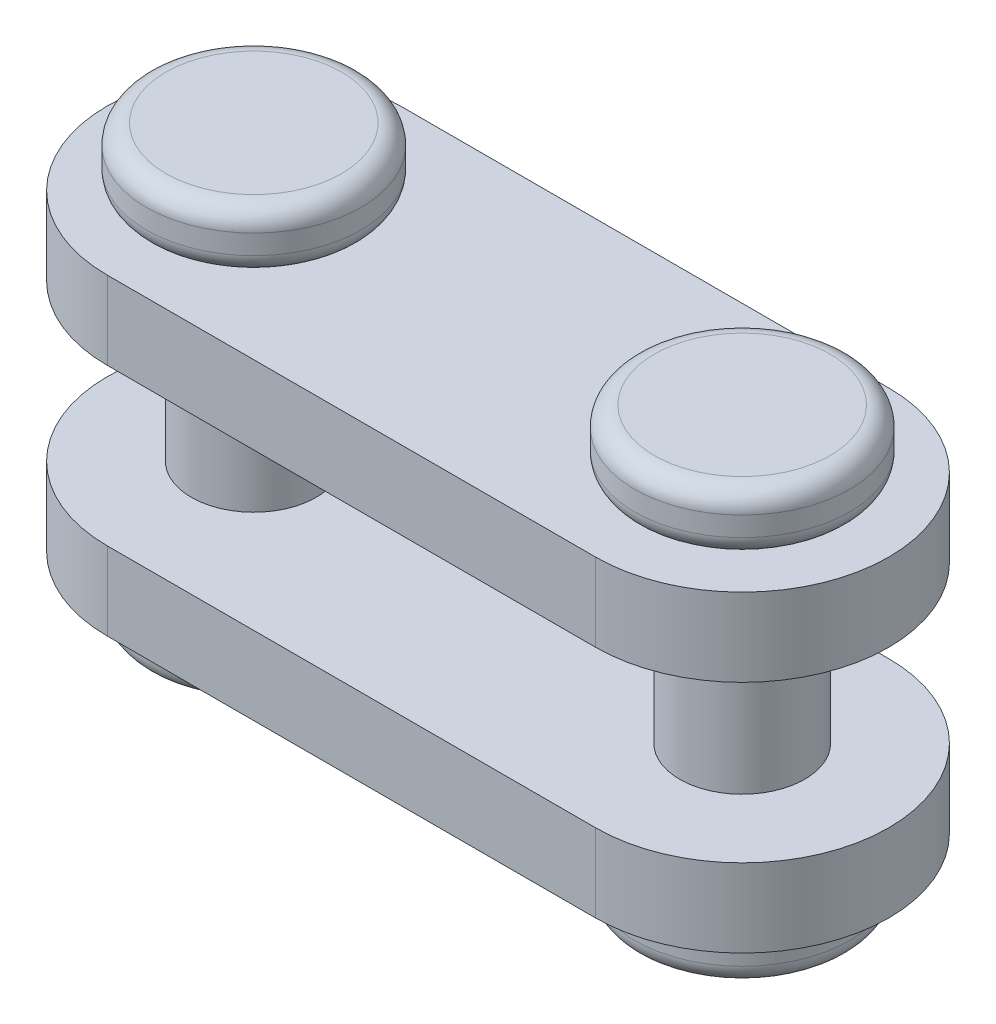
ISO-10303-21;
HEADER;
FILE_DESCRIPTION(('STEP AP214'),'2;1');
FILE_NAME('part.step','',(''),(''),'','','');
FILE_SCHEMA(('AUTOMOTIVE_DESIGN { 1 0 10303 214 1 1 1 1 }'));
ENDSEC;
DATA;
#1=APPLICATION_CONTEXT('core data for automotive mechanical design processes');
#2=APPLICATION_PROTOCOL_DEFINITION('international standard','automotive_design',2000,#1);
#3=PRODUCT_CONTEXT('',#1,'mechanical');
#4=PRODUCT('Part','Part','',(#3));
#5=PRODUCT_RELATED_PRODUCT_CATEGORY('part','',(#4));
#6=PRODUCT_DEFINITION_FORMATION('','',#4);
#7=PRODUCT_DEFINITION_CONTEXT('part definition',#1,'design');
#8=PRODUCT_DEFINITION('design','',#6,#7);
#9=PRODUCT_DEFINITION_SHAPE('','',#8);
#10=(LENGTH_UNIT() NAMED_UNIT(*) SI_UNIT(.MILLI.,.METRE.));
#11=(NAMED_UNIT(*) PLANE_ANGLE_UNIT() SI_UNIT($,.RADIAN.));
#12=(NAMED_UNIT(*) SI_UNIT($,.STERADIAN.) SOLID_ANGLE_UNIT());
#13=UNCERTAINTY_MEASURE_WITH_UNIT(LENGTH_MEASURE(1.E-05),#10,'distance_accuracy_value','');
#14=(GEOMETRIC_REPRESENTATION_CONTEXT(3) GLOBAL_UNCERTAINTY_ASSIGNED_CONTEXT((#13)) GLOBAL_UNIT_ASSIGNED_CONTEXT((#10,
#11,#12)) REPRESENTATION_CONTEXT('',''));
#15=CARTESIAN_POINT('',(0.,0.,0.));
#16=DIRECTION('',(0.,0.,1.));
#17=DIRECTION('',(1.,0.,0.));
#18=AXIS2_PLACEMENT_3D('',#15,#16,#17);
#19=CARTESIAN_POINT('',(12.5000000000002,-4.00000000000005,-5.67254576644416E-13));
#20=DIRECTION('',(0.,1.,0.));
#21=DIRECTION('',(1.,0.,0.));
#22=AXIS2_PLACEMENT_3D('',#19,#20,#21);
#23=CYLINDRICAL_SURFACE('',#22,3.75);
#24=DIRECTION('',(0.,1.,0.));
#25=VECTOR('',#24,1.);
#26=CARTESIAN_POINT('',(12.5000000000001,-4.00000000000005,-3.75000000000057));
#27=LINE('',#26,#25);
#28=CARTESIAN_POINT('',(12.5000000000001,-4.00000000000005,-3.75000000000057));
#29=VERTEX_POINT('',#28);
#30=CARTESIAN_POINT('',(12.5000000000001,-2.00000000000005,-3.75000000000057));
#31=VERTEX_POINT('',#30);
#32=EDGE_CURVE('E752',#29,#31,#27,.T.);
#33=ORIENTED_EDGE('',*,*,#32,.T.);
#34=CARTESIAN_POINT('',(12.5000000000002,-2.00000000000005,-5.67254576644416E-13));
#35=DIRECTION('',(0.,1.,0.));
#36=DIRECTION('',(1.,0.,0.));
#37=AXIS2_PLACEMENT_3D('',#34,#35,#36);
#38=CIRCLE('',#37,3.75);
#39=CARTESIAN_POINT('',(12.5000000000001,-2.00000000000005,3.74999999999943));
#40=VERTEX_POINT('',#39);
#41=EDGE_CURVE('E770',#31,#40,#38,.F.);
#42=ORIENTED_EDGE('',*,*,#41,.T.);
#43=DIRECTION('',(0.,-1.,0.));
#44=VECTOR('',#43,1.);
#45=CARTESIAN_POINT('',(12.5000000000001,-4.00000000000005,3.74999999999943));
#46=LINE('',#45,#44);
#47=CARTESIAN_POINT('',(12.5000000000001,-4.00000000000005,3.74999999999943));
#48=VERTEX_POINT('',#47);
#49=EDGE_CURVE('E763',#40,#48,#46,.T.);
#50=ORIENTED_EDGE('',*,*,#49,.T.);
#51=CARTESIAN_POINT('',(12.5000000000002,-4.00000000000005,-5.67254576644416E-13));
#52=DIRECTION('',(0.,1.,0.));
#53=DIRECTION('',(1.,0.,0.));
#54=AXIS2_PLACEMENT_3D('',#51,#52,#53);
#55=CIRCLE('',#54,3.75);
#56=EDGE_CURVE('E753',#48,#29,#55,.T.);
#57=ORIENTED_EDGE('',*,*,#56,.T.);
#58=EDGE_LOOP('',(#33,#42,#50,#57));
#59=FACE_BOUND('',#58,.T.);
#60=ADVANCED_FACE('F14',(#59),#23,.T.);
#61=CARTESIAN_POINT('',(12.5000000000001,-4.00000000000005,3.74999999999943));
#62=DIRECTION('',(0.,0.,-1.));
#63=DIRECTION('',(0.,-1.,0.));
#64=AXIS2_PLACEMENT_3D('',#61,#62,#63);
#65=PLANE('',#64);
#66=DIRECTION('',(0.,1.,0.));
#67=VECTOR('',#66,1.);
#68=CARTESIAN_POINT('',(1.38777878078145E-13,-4.00000000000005,3.74999999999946));
#69=LINE('',#68,#67);
#70=CARTESIAN_POINT('',(1.38777878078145E-13,-4.00000000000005,3.74999999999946));
#71=VERTEX_POINT('',#70);
#72=CARTESIAN_POINT('',(1.38777878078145E-13,-2.00000000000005,3.74999999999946));
#73=VERTEX_POINT('',#72);
#74=EDGE_CURVE('E744',#71,#73,#69,.T.);
#75=ORIENTED_EDGE('',*,*,#74,.F.);
#76=DIRECTION('',(-1.,0.,0.));
#77=VECTOR('',#76,1.);
#78=CARTESIAN_POINT('',(12.5000000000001,-4.00000000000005,3.74999999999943));
#79=LINE('',#78,#77);
#80=EDGE_CURVE('E739',#48,#71,#79,.T.);
#81=ORIENTED_EDGE('',*,*,#80,.F.);
#82=ORIENTED_EDGE('',*,*,#49,.F.);
#83=DIRECTION('',(-1.,0.,0.));
#84=VECTOR('',#83,1.);
#85=CARTESIAN_POINT('',(12.5000000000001,-2.00000000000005,3.74999999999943));
#86=LINE('',#85,#84);
#87=EDGE_CURVE('E769',#40,#73,#86,.T.);
#88=ORIENTED_EDGE('',*,*,#87,.T.);
#89=EDGE_LOOP('',(#75,#81,#82,#88));
#90=FACE_BOUND('',#89,.T.);
#91=ADVANCED_FACE('F648',(#90),#65,.F.);
#92=CARTESIAN_POINT('',(1.17961196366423E-13,-4.00000000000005,-5.42968447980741E-13));
#93=DIRECTION('',(0.,1.,0.));
#94=DIRECTION('',(1.,0.,0.));
#95=AXIS2_PLACEMENT_3D('',#92,#93,#94);
#96=CYLINDRICAL_SURFACE('',#95,3.75);
#97=CARTESIAN_POINT('',(1.17961196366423E-13,-4.00000000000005,-5.42968447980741E-13));
#98=DIRECTION('',(0.,1.,0.));
#99=DIRECTION('',(1.,0.,0.));
#100=AXIS2_PLACEMENT_3D('',#97,#98,#99);
#101=CIRCLE('',#100,3.75);
#102=CARTESIAN_POINT('',(1.52655665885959E-13,-4.00000000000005,-3.75000000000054));
#103=VERTEX_POINT('',#102);
#104=EDGE_CURVE('E731',#103,#71,#101,.T.);
#105=ORIENTED_EDGE('',*,*,#104,.T.);
#106=ORIENTED_EDGE('',*,*,#74,.T.);
#107=CARTESIAN_POINT('',(1.17961196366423E-13,-2.00000000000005,-5.42968447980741E-13));
#108=DIRECTION('',(0.,1.,0.));
#109=DIRECTION('',(1.,0.,0.));
#110=AXIS2_PLACEMENT_3D('',#107,#108,#109);
#111=CIRCLE('',#110,3.75);
#112=CARTESIAN_POINT('',(1.52655665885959E-13,-2.00000000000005,-3.75000000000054));
#113=VERTEX_POINT('',#112);
#114=EDGE_CURVE('E757',#73,#113,#111,.F.);
#115=ORIENTED_EDGE('',*,*,#114,.T.);
#116=DIRECTION('',(0.,1.,0.));
#117=VECTOR('',#116,1.);
#118=CARTESIAN_POINT('',(1.52655665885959E-13,-4.00000000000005,-3.75000000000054));
#119=LINE('',#118,#117);
#120=EDGE_CURVE('E749',#113,#103,#119,.F.);
#121=ORIENTED_EDGE('',*,*,#120,.T.);
#122=EDGE_LOOP('',(#105,#106,#115,#121));
#123=FACE_BOUND('',#122,.T.);
#124=ADVANCED_FACE('F658',(#123),#96,.T.);
#125=CARTESIAN_POINT('',(1.52655665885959E-13,-4.00000000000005,-3.75000000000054));
#126=DIRECTION('',(0.,0.,1.));
#127=DIRECTION('',(0.,1.,0.));
#128=AXIS2_PLACEMENT_3D('',#125,#126,#127);
#129=PLANE('',#128);
#130=ORIENTED_EDGE('',*,*,#32,.F.);
#131=DIRECTION('',(-1.,0.,0.));
#132=VECTOR('',#131,1.);
#133=CARTESIAN_POINT('',(1.52655665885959E-13,-4.00000000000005,-3.75000000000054));
#134=LINE('',#133,#132);
#135=EDGE_CURVE('E735',#103,#29,#134,.F.);
#136=ORIENTED_EDGE('',*,*,#135,.F.);
#137=ORIENTED_EDGE('',*,*,#120,.F.);
#138=DIRECTION('',(-1.,0.,0.));
#139=VECTOR('',#138,1.);
#140=CARTESIAN_POINT('',(12.5000000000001,-2.00000000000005,-3.75000000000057));
#141=LINE('',#140,#139);
#142=EDGE_CURVE('E768',#113,#31,#141,.F.);
#143=ORIENTED_EDGE('',*,*,#142,.T.);
#144=EDGE_LOOP('',(#130,#136,#137,#143));
#145=FACE_BOUND('',#144,.T.);
#146=ADVANCED_FACE('F667',(#145),#129,.F.);
#147=CARTESIAN_POINT('',(12.5000000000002,-2.00000000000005,-5.67254576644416E-13));
#148=DIRECTION('',(0.,-1.,0.));
#149=DIRECTION('',(-1.,0.,0.));
#150=AXIS2_PLACEMENT_3D('',#147,#148,#149);
#151=PLANE('',#150);
#152=ORIENTED_EDGE('',*,*,#142,.F.);
#153=ORIENTED_EDGE('',*,*,#114,.F.);
#154=ORIENTED_EDGE('',*,*,#87,.F.);
#155=ORIENTED_EDGE('',*,*,#41,.F.);
#156=EDGE_LOOP('',(#152,#153,#154,#155));
#157=FACE_BOUND('',#156,.T.);
#158=CARTESIAN_POINT('',(1.17961196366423E-13,-2.00000000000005,-5.42968447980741E-13));
#159=DIRECTION('',(0.,-1.,0.));
#160=DIRECTION('',(-1.,0.,0.));
#161=AXIS2_PLACEMENT_3D('',#158,#159,#160);
#162=CIRCLE('',#161,1.6);
#163=CARTESIAN_POINT('',(-1.59999999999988,-2.00000000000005,-5.40836819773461E-13));
#164=VERTEX_POINT('',#163);
#165=EDGE_CURVE('E773',#164,#164,#162,.F.);
#166=ORIENTED_EDGE('',*,*,#165,.F.);
#167=EDGE_LOOP('',(#166));
#168=FACE_BOUND('',#167,.T.);
#169=CARTESIAN_POINT('',(12.5000000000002,-2.00000000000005,-5.67254576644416E-13));
#170=DIRECTION('',(0.,-1.,0.));
#171=DIRECTION('',(-1.,0.,0.));
#172=AXIS2_PLACEMENT_3D('',#169,#170,#171);
#173=CIRCLE('',#172,1.6);
#174=CARTESIAN_POINT('',(10.9000000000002,-2.00000000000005,-5.65122948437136E-13));
#175=VERTEX_POINT('',#174);
#176=EDGE_CURVE('E776',#175,#175,#173,.F.);
#177=ORIENTED_EDGE('',*,*,#176,.F.);
#178=EDGE_LOOP('',(#177));
#179=FACE_BOUND('',#178,.T.);
#180=ADVANCED_FACE('F677',(#157,#168,#179),#151,.F.);
#181=CARTESIAN_POINT('',(12.5000000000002,-4.00000000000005,-5.67254576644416E-13));
#182=DIRECTION('',(0.,-1.,0.));
#183=DIRECTION('',(-1.,0.,0.));
#184=AXIS2_PLACEMENT_3D('',#181,#182,#183);
#185=PLANE('',#184);
#186=CARTESIAN_POINT('',(12.5,-4.,-2.09901540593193E-13));
#187=DIRECTION('',(0.,-1.,0.));
#188=DIRECTION('',(-0.784264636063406,0.,-0.620426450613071));
#189=AXIS2_PLACEMENT_3D('',#186,#187,#188);
#190=CIRCLE('',#189,2.25);
#191=CARTESIAN_POINT('',(14.2645954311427,-4.00000000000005,1.39595951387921));
#192=VERTEX_POINT('',#191);
#193=CARTESIAN_POINT('',(10.7354045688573,-4.00000000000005,-1.39595951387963));
#194=VERTEX_POINT('',#193);
#195=EDGE_CURVE('E220',#192,#194,#190,.F.);
#196=ORIENTED_EDGE('',*,*,#195,.T.);
#197=CARTESIAN_POINT('',(12.5,-4.,-2.09901540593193E-13));
#198=DIRECTION('',(0.,-1.,0.));
#199=DIRECTION('',(0.784264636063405,0.,0.620426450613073));
#200=AXIS2_PLACEMENT_3D('',#197,#198,#199);
#201=CIRCLE('',#200,2.25);
#202=EDGE_CURVE('E790',#194,#192,#201,.F.);
#203=ORIENTED_EDGE('',*,*,#202,.T.);
#204=EDGE_LOOP('',(#196,#203));
#205=FACE_BOUND('',#204,.T.);
#206=ORIENTED_EDGE('',*,*,#104,.F.);
#207=ORIENTED_EDGE('',*,*,#135,.T.);
#208=ORIENTED_EDGE('',*,*,#56,.F.);
#209=ORIENTED_EDGE('',*,*,#80,.T.);
#210=EDGE_LOOP('',(#206,#207,#208,#209));
#211=FACE_BOUND('',#210,.T.);
#212=CARTESIAN_POINT('',(0.,-4.00000000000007,0.));
#213=DIRECTION('',(0.,-1.,0.));
#214=DIRECTION('',(-0.653512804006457,0.,0.756915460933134));
#215=AXIS2_PLACEMENT_3D('',#212,#213,#214);
#216=CIRCLE('',#215,2.25000000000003);
#217=CARTESIAN_POINT('',(1.47040380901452,-4.00000000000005,-1.70305978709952));
#218=VERTEX_POINT('',#217);
#219=CARTESIAN_POINT('',(-1.47040380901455,-4.00000000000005,1.70305978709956));
#220=VERTEX_POINT('',#219);
#221=EDGE_CURVE('E27',#218,#220,#216,.F.);
#222=ORIENTED_EDGE('',*,*,#221,.T.);
#223=CARTESIAN_POINT('',(0.,-4.00000000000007,0.));
#224=DIRECTION('',(0.,-1.,0.));
#225=DIRECTION('',(0.653512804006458,0.,-0.756915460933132));
#226=AXIS2_PLACEMENT_3D('',#223,#224,#225);
#227=CIRCLE('',#226,2.25000000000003);
#228=EDGE_CURVE('E9',#220,#218,#227,.F.);
#229=ORIENTED_EDGE('',*,*,#228,.T.);
#230=EDGE_LOOP('',(#222,#229));
#231=FACE_BOUND('',#230,.T.);
#232=ADVANCED_FACE('F202',(#205,#211,#231),#185,.T.);
#233=CARTESIAN_POINT('',(12.5,5.49999999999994,-2.09901540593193E-13));
#234=DIRECTION('',(0.,-1.,0.));
#235=DIRECTION('',(0.784264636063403,0.,0.620426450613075));
#236=AXIS2_PLACEMENT_3D('',#233,#234,#235);
#237=PLANE('',#236);
#238=CARTESIAN_POINT('',(12.5,5.5,-2.09901540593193E-13));
#239=DIRECTION('',(0.,-1.,0.));
#240=DIRECTION('',(0.784264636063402,0.,0.620426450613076));
#241=AXIS2_PLACEMENT_3D('',#238,#239,#240);
#242=CIRCLE('',#241,2.25000000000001);
#243=CARTESIAN_POINT('',(14.2645954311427,5.49999999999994,1.39595951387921));
#244=VERTEX_POINT('',#243);
#245=CARTESIAN_POINT('',(10.7354045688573,5.49999999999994,-1.39595951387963));
#246=VERTEX_POINT('',#245);
#247=EDGE_CURVE('E109',#244,#246,#242,.T.);
#248=ORIENTED_EDGE('',*,*,#247,.F.);
#249=CARTESIAN_POINT('',(12.5,5.5,-2.09901540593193E-13));
#250=DIRECTION('',(0.,-1.,0.));
#251=DIRECTION('',(-0.784264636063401,0.,-0.620426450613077));
#252=AXIS2_PLACEMENT_3D('',#249,#250,#251);
#253=CIRCLE('',#252,2.25000000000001);
#254=EDGE_CURVE('E143',#246,#244,#253,.T.);
#255=ORIENTED_EDGE('',*,*,#254,.F.);
#256=EDGE_LOOP('',(#248,#255));
#257=FACE_BOUND('',#256,.T.);
#258=ADVANCED_FACE('F133',(#257),#237,.F.);
#259=CARTESIAN_POINT('',(0.,5.49999999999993,0.));
#260=DIRECTION('',(0.,-1.,0.));
#261=DIRECTION('',(0.653512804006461,0.,-0.75691546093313));
#262=AXIS2_PLACEMENT_3D('',#259,#260,#261);
#263=PLANE('',#262);
#264=CARTESIAN_POINT('',(0.,5.49999999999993,0.));
#265=DIRECTION('',(0.,-1.,0.));
#266=DIRECTION('',(0.653512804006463,0.,-0.756915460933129));
#267=AXIS2_PLACEMENT_3D('',#264,#265,#266);
#268=CIRCLE('',#267,2.24999999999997);
#269=CARTESIAN_POINT('',(1.47040380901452,5.49999999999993,-1.70305978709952));
#270=VERTEX_POINT('',#269);
#271=CARTESIAN_POINT('',(-1.47040380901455,5.49999999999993,1.70305978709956));
#272=VERTEX_POINT('',#271);
#273=EDGE_CURVE('E318',#270,#272,#268,.T.);
#274=ORIENTED_EDGE('',*,*,#273,.F.);
#275=CARTESIAN_POINT('',(0.,5.49999999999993,0.));
#276=DIRECTION('',(0.,-1.,0.));
#277=DIRECTION('',(-0.653512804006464,0.,0.756915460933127));
#278=AXIS2_PLACEMENT_3D('',#275,#276,#277);
#279=CIRCLE('',#278,2.24999999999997);
#280=EDGE_CURVE('E315',#272,#270,#279,.T.);
#281=ORIENTED_EDGE('',*,*,#280,.F.);
#282=EDGE_LOOP('',(#274,#281));
#283=FACE_BOUND('',#282,.T.);
#284=ADVANCED_FACE('F243',(#283),#263,.F.);
#285=CARTESIAN_POINT('',(12.5,5.,-2.09901540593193E-13));
#286=DIRECTION('',(0.,-1.,0.));
#287=DIRECTION('',(0.784264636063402,0.,0.620426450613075));
#288=AXIS2_PLACEMENT_3D('',#285,#286,#287);
#289=TOROIDAL_SURFACE('',#288,2.25000000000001,0.5);
#290=ORIENTED_EDGE('',*,*,#247,.T.);
#291=ORIENTED_EDGE('',*,*,#254,.T.);
#292=EDGE_LOOP('',(#290,#291));
#293=FACE_BOUND('',#292,.T.);
#294=CARTESIAN_POINT('',(12.5,5.,-2.09901540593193E-13));
#295=DIRECTION('',(0.,1.,0.));
#296=DIRECTION('',(-0.784264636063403,0.,-0.620426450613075));
#297=AXIS2_PLACEMENT_3D('',#294,#295,#296);
#298=CIRCLE('',#297,2.75);
#299=CARTESIAN_POINT('',(10.3432722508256,5.,-1.70617273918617));
#300=VERTEX_POINT('',#299);
#301=EDGE_CURVE('E139',#300,#300,#298,.F.);
#302=ORIENTED_EDGE('',*,*,#301,.F.);
#303=EDGE_LOOP('',(#302));
#304=FACE_BOUND('',#303,.T.);
#305=ADVANCED_FACE('F129',(#293,#304),#289,.T.);
#306=CARTESIAN_POINT('',(0.,4.99999999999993,0.));
#307=DIRECTION('',(0.,-1.,0.));
#308=DIRECTION('',(0.653512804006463,0.,-0.756915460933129));
#309=AXIS2_PLACEMENT_3D('',#306,#307,#308);
#310=TOROIDAL_SURFACE('',#309,2.24999999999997,0.5);
#311=ORIENTED_EDGE('',*,*,#273,.T.);
#312=ORIENTED_EDGE('',*,*,#280,.T.);
#313=EDGE_LOOP('',(#311,#312));
#314=FACE_BOUND('',#313,.T.);
#315=CARTESIAN_POINT('',(0.,4.99999999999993,0.));
#316=DIRECTION('',(0.,1.,0.));
#317=DIRECTION('',(-0.653512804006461,0.,0.75691546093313));
#318=AXIS2_PLACEMENT_3D('',#315,#316,#317);
#319=CIRCLE('',#318,2.75);
#320=CARTESIAN_POINT('',(-1.79716021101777,4.99999999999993,2.08151751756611));
#321=VERTEX_POINT('',#320);
#322=EDGE_CURVE('E308',#321,#321,#319,.F.);
#323=ORIENTED_EDGE('',*,*,#322,.F.);
#324=EDGE_LOOP('',(#323));
#325=FACE_BOUND('',#324,.T.);
#326=ADVANCED_FACE('F242',(#314,#325),#310,.T.);
#327=CARTESIAN_POINT('',(12.5,3.99999999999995,-2.09901540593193E-13));
#328=DIRECTION('',(0.,1.,0.));
#329=DIRECTION('',(-0.784264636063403,0.,-0.620426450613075));
#330=AXIS2_PLACEMENT_3D('',#327,#328,#329);
#331=CYLINDRICAL_SURFACE('',#330,2.75);
#332=CARTESIAN_POINT('',(12.5,4.49999999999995,-2.09901540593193E-13));
#333=DIRECTION('',(0.,-1.,0.));
#334=DIRECTION('',(0.784264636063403,0.,0.620426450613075));
#335=AXIS2_PLACEMENT_3D('',#332,#333,#334);
#336=CIRCLE('',#335,2.75);
#337=CARTESIAN_POINT('',(14.6567277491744,4.49999999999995,1.70617273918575));
#338=VERTEX_POINT('',#337);
#339=EDGE_CURVE('E225',#338,#338,#336,.T.);
#340=ORIENTED_EDGE('',*,*,#339,.F.);
#341=EDGE_LOOP('',(#340));
#342=FACE_BOUND('',#341,.T.);
#343=ORIENTED_EDGE('',*,*,#301,.T.);
#344=EDGE_LOOP('',(#343));
#345=FACE_BOUND('',#344,.T.);
#346=ADVANCED_FACE('F207',(#342,#345),#331,.T.);
#347=CARTESIAN_POINT('',(0.,3.99999999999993,0.));
#348=DIRECTION('',(0.,1.,0.));
#349=DIRECTION('',(-0.653512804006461,0.,0.75691546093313));
#350=AXIS2_PLACEMENT_3D('',#347,#348,#349);
#351=CYLINDRICAL_SURFACE('',#350,2.75);
#352=CARTESIAN_POINT('',(0.,4.49999999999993,0.));
#353=DIRECTION('',(0.,-1.,0.));
#354=DIRECTION('',(0.653512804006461,0.,-0.75691546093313));
#355=AXIS2_PLACEMENT_3D('',#352,#353,#354);
#356=CIRCLE('',#355,2.75);
#357=CARTESIAN_POINT('',(1.79716021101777,4.49999999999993,-2.08151751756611));
#358=VERTEX_POINT('',#357);
#359=EDGE_CURVE('E485',#358,#358,#356,.T.);
#360=ORIENTED_EDGE('',*,*,#359,.F.);
#361=EDGE_LOOP('',(#360));
#362=FACE_BOUND('',#361,.T.);
#363=ORIENTED_EDGE('',*,*,#322,.T.);
#364=EDGE_LOOP('',(#363));
#365=FACE_BOUND('',#364,.T.);
#366=ADVANCED_FACE('F252',(#362,#365),#351,.T.);
#367=CARTESIAN_POINT('',(12.5,4.49999999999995,-2.09901540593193E-13));
#368=DIRECTION('',(0.,-1.,0.));
#369=DIRECTION('',(0.784264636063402,0.,0.620426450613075));
#370=AXIS2_PLACEMENT_3D('',#367,#368,#369);
#371=TOROIDAL_SURFACE('',#370,2.25000000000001,0.5);
#372=ORIENTED_EDGE('',*,*,#339,.T.);
#373=EDGE_LOOP('',(#372));
#374=FACE_BOUND('',#373,.T.);
#375=CARTESIAN_POINT('',(12.5,3.99999999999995,-2.09901540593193E-13));
#376=DIRECTION('',(0.,1.,0.));
#377=DIRECTION('',(0.7842646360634,0.,0.620426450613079));
#378=AXIS2_PLACEMENT_3D('',#375,#376,#377);
#379=CIRCLE('',#378,2.25000000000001);
#380=CARTESIAN_POINT('',(10.7354045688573,3.99999999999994,-1.39595951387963));
#381=VERTEX_POINT('',#380);
#382=CARTESIAN_POINT('',(14.2645954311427,3.99999999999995,1.39595951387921));
#383=VERTEX_POINT('',#382);
#384=EDGE_CURVE('E422',#381,#383,#379,.F.);
#385=ORIENTED_EDGE('',*,*,#384,.F.);
#386=CARTESIAN_POINT('',(12.5,3.99999999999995,-2.09901540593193E-13));
#387=DIRECTION('',(0.,1.,0.));
#388=DIRECTION('',(-0.784264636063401,0.,-0.620426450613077));
#389=AXIS2_PLACEMENT_3D('',#386,#387,#388);
#390=CIRCLE('',#389,2.25000000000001);
#391=EDGE_CURVE('E424',#383,#381,#390,.F.);
#392=ORIENTED_EDGE('',*,*,#391,.F.);
#393=EDGE_LOOP('',(#385,#392));
#394=FACE_BOUND('',#393,.T.);
#395=ADVANCED_FACE('F203',(#374,#394),#371,.T.);
#396=CARTESIAN_POINT('',(0.,4.49999999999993,0.));
#397=DIRECTION('',(0.,-1.,0.));
#398=DIRECTION('',(0.653512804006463,0.,-0.756915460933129));
#399=AXIS2_PLACEMENT_3D('',#396,#397,#398);
#400=TOROIDAL_SURFACE('',#399,2.24999999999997,0.5);
#401=ORIENTED_EDGE('',*,*,#359,.T.);
#402=EDGE_LOOP('',(#401));
#403=FACE_BOUND('',#402,.T.);
#404=CARTESIAN_POINT('',(0.,3.99999999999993,0.));
#405=DIRECTION('',(0.,1.,0.));
#406=DIRECTION('',(0.653512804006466,0.,-0.756915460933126));
#407=AXIS2_PLACEMENT_3D('',#404,#405,#406);
#408=CIRCLE('',#407,2.24999999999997);
#409=CARTESIAN_POINT('',(-1.47040380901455,3.99999999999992,1.70305978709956));
#410=VERTEX_POINT('',#409);
#411=CARTESIAN_POINT('',(1.47040380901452,3.99999999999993,-1.70305978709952));
#412=VERTEX_POINT('',#411);
#413=EDGE_CURVE('E430',#410,#412,#408,.F.);
#414=ORIENTED_EDGE('',*,*,#413,.F.);
#415=CARTESIAN_POINT('',(0.,3.99999999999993,0.));
#416=DIRECTION('',(0.,1.,0.));
#417=DIRECTION('',(-0.653512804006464,0.,0.756915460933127));
#418=AXIS2_PLACEMENT_3D('',#415,#416,#417);
#419=CIRCLE('',#418,2.24999999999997);
#420=EDGE_CURVE('E384',#412,#410,#419,.F.);
#421=ORIENTED_EDGE('',*,*,#420,.F.);
#422=EDGE_LOOP('',(#414,#421));
#423=FACE_BOUND('',#422,.T.);
#424=ADVANCED_FACE('F259',(#403,#423),#400,.T.);
#425=CARTESIAN_POINT('',(12.5000000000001,3.99999999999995,-5.36029554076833E-13));
#426=DIRECTION('',(0.,-1.,0.));
#427=DIRECTION('',(-1.,0.,0.));
#428=AXIS2_PLACEMENT_3D('',#425,#426,#427);
#429=PLANE('',#428);
#430=ORIENTED_EDGE('',*,*,#413,.T.);
#431=ORIENTED_EDGE('',*,*,#420,.T.);
#432=EDGE_LOOP('',(#430,#431));
#433=FACE_BOUND('',#432,.T.);
#434=ORIENTED_EDGE('',*,*,#384,.T.);
#435=ORIENTED_EDGE('',*,*,#391,.T.);
#436=EDGE_LOOP('',(#434,#435));
#437=FACE_BOUND('',#436,.T.);
#438=DIRECTION('',(-1.,0.,0.));
#439=VECTOR('',#438,1.);
#440=CARTESIAN_POINT('',(12.5000000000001,3.99999999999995,-3.75000000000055));
#441=LINE('',#440,#439);
#442=CARTESIAN_POINT('',(1.45716771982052E-13,3.99999999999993,-3.75000000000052));
#443=VERTEX_POINT('',#442);
#444=CARTESIAN_POINT('',(12.5000000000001,3.99999999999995,-3.75000000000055));
#445=VERTEX_POINT('',#444);
#446=EDGE_CURVE('E427',#443,#445,#441,.F.);
#447=ORIENTED_EDGE('',*,*,#446,.F.);
#448=CARTESIAN_POINT('',(1.52655665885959E-13,3.99999999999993,-5.15212872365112E-13));
#449=DIRECTION('',(0.,1.,0.));
#450=DIRECTION('',(1.,0.,0.));
#451=AXIS2_PLACEMENT_3D('',#448,#449,#450);
#452=CIRCLE('',#451,3.75);
#453=CARTESIAN_POINT('',(1.38777878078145E-13,3.99999999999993,3.74999999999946));
#454=VERTEX_POINT('',#453);
#455=EDGE_CURVE('E818',#454,#443,#452,.F.);
#456=ORIENTED_EDGE('',*,*,#455,.F.);
#457=DIRECTION('',(-1.,0.,0.));
#458=VECTOR('',#457,1.);
#459=CARTESIAN_POINT('',(12.5000000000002,3.99999999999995,3.74999999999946));
#460=LINE('',#459,#458);
#461=CARTESIAN_POINT('',(12.5000000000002,3.99999999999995,3.74999999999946));
#462=VERTEX_POINT('',#461);
#463=EDGE_CURVE('E819',#462,#454,#460,.T.);
#464=ORIENTED_EDGE('',*,*,#463,.F.);
#465=CARTESIAN_POINT('',(12.5000000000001,3.99999999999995,-5.36029554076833E-13));
#466=DIRECTION('',(0.,1.,0.));
#467=DIRECTION('',(1.,0.,0.));
#468=AXIS2_PLACEMENT_3D('',#465,#466,#467);
#469=CIRCLE('',#468,3.75);
#470=EDGE_CURVE('E822',#445,#462,#469,.F.);
#471=ORIENTED_EDGE('',*,*,#470,.F.);
#472=EDGE_LOOP('',(#447,#456,#464,#471));
#473=FACE_BOUND('',#472,.T.);
#474=ADVANCED_FACE('F261',(#433,#437,#473),#429,.F.);
#475=CARTESIAN_POINT('',(12.5000000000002,1.99999999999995,3.74999999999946));
#476=DIRECTION('',(0.,0.,-1.));
#477=DIRECTION('',(0.,-1.,0.));
#478=AXIS2_PLACEMENT_3D('',#475,#476,#477);
#479=PLANE('',#478);
#480=DIRECTION('',(0.,1.,0.));
#481=VECTOR('',#480,1.);
#482=CARTESIAN_POINT('',(1.38777878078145E-13,1.99999999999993,3.74999999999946));
#483=LINE('',#482,#481);
#484=CARTESIAN_POINT('',(1.38777878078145E-13,1.99999999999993,3.74999999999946));
#485=VERTEX_POINT('',#484);
#486=EDGE_CURVE('E831',#485,#454,#483,.T.);
#487=ORIENTED_EDGE('',*,*,#486,.F.);
#488=DIRECTION('',(-1.,0.,0.));
#489=VECTOR('',#488,1.);
#490=CARTESIAN_POINT('',(12.5000000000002,1.99999999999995,3.74999999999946));
#491=LINE('',#490,#489);
#492=CARTESIAN_POINT('',(12.5000000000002,1.99999999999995,3.74999999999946));
#493=VERTEX_POINT('',#492);
#494=EDGE_CURVE('E837',#493,#485,#491,.T.);
#495=ORIENTED_EDGE('',*,*,#494,.F.);
#496=DIRECTION('',(0.,-1.,0.));
#497=VECTOR('',#496,1.);
#498=CARTESIAN_POINT('',(12.5000000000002,1.99999999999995,3.74999999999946));
#499=LINE('',#498,#497);
#500=EDGE_CURVE('E834',#462,#493,#499,.T.);
#501=ORIENTED_EDGE('',*,*,#500,.F.);
#502=ORIENTED_EDGE('',*,*,#463,.T.);
#503=EDGE_LOOP('',(#487,#495,#501,#502));
#504=FACE_BOUND('',#503,.T.);
#505=ADVANCED_FACE('F269',(#504),#479,.F.);
#506=CARTESIAN_POINT('',(12.5000000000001,1.99999999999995,-5.51642065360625E-13));
#507=DIRECTION('',(0.,1.,0.));
#508=DIRECTION('',(1.,0.,0.));
#509=AXIS2_PLACEMENT_3D('',#506,#507,#508);
#510=CYLINDRICAL_SURFACE('',#509,3.75);
#511=DIRECTION('',(0.,1.,0.));
#512=VECTOR('',#511,1.);
#513=CARTESIAN_POINT('',(12.5000000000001,1.99999999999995,-3.75000000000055));
#514=LINE('',#513,#512);
#515=CARTESIAN_POINT('',(12.5000000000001,1.99999999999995,-3.75000000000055));
#516=VERTEX_POINT('',#515);
#517=EDGE_CURVE('E823',#516,#445,#514,.T.);
#518=ORIENTED_EDGE('',*,*,#517,.T.);
#519=ORIENTED_EDGE('',*,*,#470,.T.);
#520=ORIENTED_EDGE('',*,*,#500,.T.);
#521=CARTESIAN_POINT('',(12.5000000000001,1.99999999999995,-5.51642065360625E-13));
#522=DIRECTION('',(0.,1.,0.));
#523=DIRECTION('',(1.,0.,0.));
#524=AXIS2_PLACEMENT_3D('',#521,#522,#523);
#525=CIRCLE('',#524,3.75);
#526=EDGE_CURVE('E826',#493,#516,#525,.T.);
#527=ORIENTED_EDGE('',*,*,#526,.T.);
#528=EDGE_LOOP('',(#518,#519,#520,#527));
#529=FACE_BOUND('',#528,.T.);
#530=ADVANCED_FACE('F449',(#529),#510,.T.);
#531=CARTESIAN_POINT('',(1.45716771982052E-13,1.99999999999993,-3.75000000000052));
#532=DIRECTION('',(0.,0.,1.));
#533=DIRECTION('',(0.,1.,0.));
#534=AXIS2_PLACEMENT_3D('',#531,#532,#533);
#535=PLANE('',#534);
#536=ORIENTED_EDGE('',*,*,#517,.F.);
#537=DIRECTION('',(-1.,0.,0.));
#538=VECTOR('',#537,1.);
#539=CARTESIAN_POINT('',(1.45716771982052E-13,1.99999999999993,-3.75000000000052));
#540=LINE('',#539,#538);
#541=CARTESIAN_POINT('',(1.45716771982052E-13,1.99999999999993,-3.75000000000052));
#542=VERTEX_POINT('',#541);
#543=EDGE_CURVE('E830',#542,#516,#540,.F.);
#544=ORIENTED_EDGE('',*,*,#543,.F.);
#545=DIRECTION('',(0.,1.,0.));
#546=VECTOR('',#545,1.);
#547=CARTESIAN_POINT('',(1.45716771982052E-13,1.99999999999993,-3.75000000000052));
#548=LINE('',#547,#546);
#549=EDGE_CURVE('E827',#443,#542,#548,.F.);
#550=ORIENTED_EDGE('',*,*,#549,.F.);
#551=ORIENTED_EDGE('',*,*,#446,.T.);
#552=EDGE_LOOP('',(#536,#544,#550,#551));
#553=FACE_BOUND('',#552,.T.);
#554=ADVANCED_FACE('F272',(#553),#535,.F.);
#555=CARTESIAN_POINT('',(1.52655665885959E-13,1.99999999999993,-5.15212872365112E-13));
#556=DIRECTION('',(0.,1.,0.));
#557=DIRECTION('',(1.,0.,0.));
#558=AXIS2_PLACEMENT_3D('',#555,#556,#557);
#559=CYLINDRICAL_SURFACE('',#558,3.75);
#560=CARTESIAN_POINT('',(1.52655665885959E-13,1.99999999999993,-5.15212872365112E-13));
#561=DIRECTION('',(0.,1.,0.));
#562=DIRECTION('',(1.,0.,0.));
#563=AXIS2_PLACEMENT_3D('',#560,#561,#562);
#564=CIRCLE('',#563,3.75);
#565=EDGE_CURVE('E833',#542,#485,#564,.T.);
#566=ORIENTED_EDGE('',*,*,#565,.T.);
#567=ORIENTED_EDGE('',*,*,#486,.T.);
#568=ORIENTED_EDGE('',*,*,#455,.T.);
#569=ORIENTED_EDGE('',*,*,#549,.T.);
#570=EDGE_LOOP('',(#566,#567,#568,#569));
#571=FACE_BOUND('',#570,.T.);
#572=ADVANCED_FACE('F558',(#571),#559,.T.);
#573=CARTESIAN_POINT('',(12.5000000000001,1.99999999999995,-5.51642065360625E-13));
#574=DIRECTION('',(0.,-1.,0.));
#575=DIRECTION('',(-1.,0.,0.));
#576=AXIS2_PLACEMENT_3D('',#573,#574,#575);
#577=PLANE('',#576);
#578=ORIENTED_EDGE('',*,*,#565,.F.);
#579=ORIENTED_EDGE('',*,*,#543,.T.);
#580=ORIENTED_EDGE('',*,*,#526,.F.);
#581=ORIENTED_EDGE('',*,*,#494,.T.);
#582=EDGE_LOOP('',(#578,#579,#580,#581));
#583=FACE_BOUND('',#582,.T.);
#584=CARTESIAN_POINT('',(1.52655665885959E-13,1.99999999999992,-5.15212872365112E-13));
#585=DIRECTION('',(0.,-1.,0.));
#586=DIRECTION('',(-1.,0.,0.));
#587=AXIS2_PLACEMENT_3D('',#584,#585,#586);
#588=CIRCLE('',#587,1.6);
#589=CARTESIAN_POINT('',(-1.59999999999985,1.99999999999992,-5.13081244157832E-13));
#590=VERTEX_POINT('',#589);
#591=EDGE_CURVE('E493',#590,#590,#588,.F.);
#592=ORIENTED_EDGE('',*,*,#591,.T.);
#593=EDGE_LOOP('',(#592));
#594=FACE_BOUND('',#593,.T.);
#595=CARTESIAN_POINT('',(12.5000000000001,1.99999999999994,-5.51642065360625E-13));
#596=DIRECTION('',(0.,-1.,0.));
#597=DIRECTION('',(-1.,0.,0.));
#598=AXIS2_PLACEMENT_3D('',#595,#596,#597);
#599=CIRCLE('',#598,1.6);
#600=CARTESIAN_POINT('',(10.9000000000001,1.99999999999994,-5.49510437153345E-13));
#601=VERTEX_POINT('',#600);
#602=EDGE_CURVE('E491',#601,#601,#599,.F.);
#603=ORIENTED_EDGE('',*,*,#602,.T.);
#604=EDGE_LOOP('',(#603));
#605=FACE_BOUND('',#604,.T.);
#606=ADVANCED_FACE('F256',(#583,#594,#605),#577,.T.);
#607=CARTESIAN_POINT('',(12.5,-4.5,-2.09901540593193E-13));
#608=DIRECTION('',(0.,1.,0.));
#609=DIRECTION('',(-0.784264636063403,0.,-0.620426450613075));
#610=AXIS2_PLACEMENT_3D('',#607,#608,#609);
#611=CYLINDRICAL_SURFACE('',#610,1.6);
#612=ORIENTED_EDGE('',*,*,#602,.F.);
#613=EDGE_LOOP('',(#612));
#614=FACE_BOUND('',#613,.T.);
#615=ORIENTED_EDGE('',*,*,#176,.T.);
#616=EDGE_LOOP('',(#615));
#617=FACE_BOUND('',#616,.T.);
#618=ADVANCED_FACE('F543',(#614,#617),#611,.T.);
#619=CARTESIAN_POINT('',(0.,-4.50000000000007,0.));
#620=DIRECTION('',(0.,1.,0.));
#621=DIRECTION('',(-0.653512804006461,0.,0.75691546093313));
#622=AXIS2_PLACEMENT_3D('',#619,#620,#621);
#623=CYLINDRICAL_SURFACE('',#622,1.6);
#624=ORIENTED_EDGE('',*,*,#591,.F.);
#625=EDGE_LOOP('',(#624));
#626=FACE_BOUND('',#625,.T.);
#627=ORIENTED_EDGE('',*,*,#165,.T.);
#628=EDGE_LOOP('',(#627));
#629=FACE_BOUND('',#628,.T.);
#630=ADVANCED_FACE('F536',(#626,#629),#623,.T.);
#631=CARTESIAN_POINT('',(12.5,-5.5,-2.09901540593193E-13));
#632=DIRECTION('',(0.,1.,0.));
#633=DIRECTION('',(-0.784264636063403,0.,-0.620426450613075));
#634=AXIS2_PLACEMENT_3D('',#631,#632,#633);
#635=PLANE('',#634);
#636=CARTESIAN_POINT('',(12.5,-5.5,-2.09901540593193E-13));
#637=DIRECTION('',(0.,1.,0.));
#638=DIRECTION('',(-0.784264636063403,0.,-0.620426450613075));
#639=AXIS2_PLACEMENT_3D('',#636,#637,#638);
#640=CIRCLE('',#639,2.25);
#641=CARTESIAN_POINT('',(10.7354045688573,-5.5,-1.39595951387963));
#642=VERTEX_POINT('',#641);
#643=CARTESIAN_POINT('',(14.2645954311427,-5.5,1.39595951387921));
#644=VERTEX_POINT('',#643);
#645=EDGE_CURVE('E98',#642,#644,#640,.T.);
#646=ORIENTED_EDGE('',*,*,#645,.F.);
#647=CARTESIAN_POINT('',(12.5,-5.5,-2.09901540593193E-13));
#648=DIRECTION('',(0.,1.,0.));
#649=DIRECTION('',(0.784264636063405,0.,0.620426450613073));
#650=AXIS2_PLACEMENT_3D('',#647,#648,#649);
#651=CIRCLE('',#650,2.25);
#652=EDGE_CURVE('E102',#644,#642,#651,.T.);
#653=ORIENTED_EDGE('',*,*,#652,.F.);
#654=EDGE_LOOP('',(#646,#653));
#655=FACE_BOUND('',#654,.T.);
#656=ADVANCED_FACE('F16',(#655),#635,.F.);
#657=CARTESIAN_POINT('',(12.5,-5.,-2.09901540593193E-13));
#658=DIRECTION('',(0.,1.,0.));
#659=DIRECTION('',(-0.784264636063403,0.,-0.620426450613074));
#660=AXIS2_PLACEMENT_3D('',#657,#658,#659);
#661=TOROIDAL_SURFACE('',#660,2.25,0.5);
#662=ORIENTED_EDGE('',*,*,#645,.T.);
#663=ORIENTED_EDGE('',*,*,#652,.T.);
#664=EDGE_LOOP('',(#662,#663));
#665=FACE_BOUND('',#664,.T.);
#666=CARTESIAN_POINT('',(12.5,-5.,-2.09901540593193E-13));
#667=DIRECTION('',(0.,-1.,0.));
#668=DIRECTION('',(0.784264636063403,0.,0.620426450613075));
#669=AXIS2_PLACEMENT_3D('',#666,#667,#668);
#670=CIRCLE('',#669,2.75);
#671=CARTESIAN_POINT('',(14.6567277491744,-5.,1.70617273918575));
#672=VERTEX_POINT('',#671);
#673=EDGE_CURVE('E140',#672,#672,#670,.F.);
#674=ORIENTED_EDGE('',*,*,#673,.F.);
#675=EDGE_LOOP('',(#674));
#676=FACE_BOUND('',#675,.T.);
#677=ADVANCED_FACE('F107',(#665,#676),#661,.T.);
#678=CARTESIAN_POINT('',(12.5,-4.00000000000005,-2.09901540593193E-13));
#679=DIRECTION('',(0.,-1.,0.));
#680=DIRECTION('',(0.784264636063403,0.,0.620426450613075));
#681=AXIS2_PLACEMENT_3D('',#678,#679,#680);
#682=CYLINDRICAL_SURFACE('',#681,2.75);
#683=CARTESIAN_POINT('',(12.5,-4.5,-2.09901540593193E-13));
#684=DIRECTION('',(0.,1.,0.));
#685=DIRECTION('',(-0.784264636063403,0.,-0.620426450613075));
#686=AXIS2_PLACEMENT_3D('',#683,#684,#685);
#687=CIRCLE('',#686,2.75);
#688=CARTESIAN_POINT('',(10.3432722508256,-4.5,-1.70617273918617));
#689=VERTEX_POINT('',#688);
#690=EDGE_CURVE('E234',#689,#689,#687,.T.);
#691=ORIENTED_EDGE('',*,*,#690,.F.);
#692=EDGE_LOOP('',(#691));
#693=FACE_BOUND('',#692,.T.);
#694=ORIENTED_EDGE('',*,*,#673,.T.);
#695=EDGE_LOOP('',(#694));
#696=FACE_BOUND('',#695,.T.);
#697=ADVANCED_FACE('F128',(#693,#696),#682,.T.);
#698=CARTESIAN_POINT('',(12.5,-4.5,-2.09901540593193E-13));
#699=DIRECTION('',(0.,1.,0.));
#700=DIRECTION('',(-0.784264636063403,0.,-0.620426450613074));
#701=AXIS2_PLACEMENT_3D('',#698,#699,#700);
#702=TOROIDAL_SURFACE('',#701,2.25,0.5);
#703=ORIENTED_EDGE('',*,*,#690,.T.);
#704=EDGE_LOOP('',(#703));
#705=FACE_BOUND('',#704,.T.);
#706=ORIENTED_EDGE('',*,*,#195,.F.);
#707=ORIENTED_EDGE('',*,*,#202,.F.);
#708=EDGE_LOOP('',(#706,#707));
#709=FACE_BOUND('',#708,.T.);
#710=ADVANCED_FACE('F189',(#705,#709),#702,.T.);
#711=CARTESIAN_POINT('',(0.,-5.50000000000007,0.));
#712=DIRECTION('',(0.,1.,0.));
#713=DIRECTION('',(-0.653512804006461,0.,0.75691546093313));
#714=AXIS2_PLACEMENT_3D('',#711,#712,#713);
#715=PLANE('',#714);
#716=CARTESIAN_POINT('',(0.,-5.50000000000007,0.));
#717=DIRECTION('',(0.,1.,0.));
#718=DIRECTION('',(-0.65351280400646,0.,0.756915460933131));
#719=AXIS2_PLACEMENT_3D('',#716,#717,#718);
#720=CIRCLE('',#719,2.25000000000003);
#721=CARTESIAN_POINT('',(-1.47040380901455,-5.50000000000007,1.70305978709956));
#722=VERTEX_POINT('',#721);
#723=CARTESIAN_POINT('',(1.47040380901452,-5.50000000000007,-1.70305978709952));
#724=VERTEX_POINT('',#723);
#725=EDGE_CURVE('E233',#722,#724,#720,.T.);
#726=ORIENTED_EDGE('',*,*,#725,.F.);
#727=CARTESIAN_POINT('',(0.,-5.50000000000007,0.));
#728=DIRECTION('',(0.,1.,0.));
#729=DIRECTION('',(0.653512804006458,0.,-0.756915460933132));
#730=AXIS2_PLACEMENT_3D('',#727,#728,#729);
#731=CIRCLE('',#730,2.25000000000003);
#732=EDGE_CURVE('E362',#724,#722,#731,.T.);
#733=ORIENTED_EDGE('',*,*,#732,.F.);
#734=EDGE_LOOP('',(#726,#733));
#735=FACE_BOUND('',#734,.T.);
#736=ADVANCED_FACE('F200',(#735),#715,.F.);
#737=CARTESIAN_POINT('',(0.,-5.00000000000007,0.));
#738=DIRECTION('',(0.,1.,0.));
#739=DIRECTION('',(-0.65351280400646,0.,0.756915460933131));
#740=AXIS2_PLACEMENT_3D('',#737,#738,#739);
#741=TOROIDAL_SURFACE('',#740,2.25000000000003,0.5);
#742=ORIENTED_EDGE('',*,*,#725,.T.);
#743=ORIENTED_EDGE('',*,*,#732,.T.);
#744=EDGE_LOOP('',(#742,#743));
#745=FACE_BOUND('',#744,.T.);
#746=CARTESIAN_POINT('',(0.,-5.00000000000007,0.));
#747=DIRECTION('',(0.,-1.,0.));
#748=DIRECTION('',(0.653512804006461,0.,-0.75691546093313));
#749=AXIS2_PLACEMENT_3D('',#746,#747,#748);
#750=CIRCLE('',#749,2.75);
#751=CARTESIAN_POINT('',(1.79716021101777,-5.00000000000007,-2.08151751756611));
#752=VERTEX_POINT('',#751);
#753=EDGE_CURVE('E310',#752,#752,#750,.F.);
#754=ORIENTED_EDGE('',*,*,#753,.F.);
#755=EDGE_LOOP('',(#754));
#756=FACE_BOUND('',#755,.T.);
#757=ADVANCED_FACE('F294',(#745,#756),#741,.T.);
#758=CARTESIAN_POINT('',(0.,-4.00000000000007,0.));
#759=DIRECTION('',(0.,-1.,0.));
#760=DIRECTION('',(0.653512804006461,0.,-0.75691546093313));
#761=AXIS2_PLACEMENT_3D('',#758,#759,#760);
#762=CYLINDRICAL_SURFACE('',#761,2.75);
#763=CARTESIAN_POINT('',(0.,-4.50000000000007,0.));
#764=DIRECTION('',(0.,1.,0.));
#765=DIRECTION('',(-0.653512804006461,0.,0.75691546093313));
#766=AXIS2_PLACEMENT_3D('',#763,#764,#765);
#767=CIRCLE('',#766,2.75);
#768=CARTESIAN_POINT('',(-1.79716021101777,-4.50000000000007,2.08151751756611));
#769=VERTEX_POINT('',#768);
#770=EDGE_CURVE('E306',#769,#769,#767,.T.);
#771=ORIENTED_EDGE('',*,*,#770,.F.);
#772=EDGE_LOOP('',(#771));
#773=FACE_BOUND('',#772,.T.);
#774=ORIENTED_EDGE('',*,*,#753,.T.);
#775=EDGE_LOOP('',(#774));
#776=FACE_BOUND('',#775,.T.);
#777=ADVANCED_FACE('F292',(#773,#776),#762,.T.);
#778=CARTESIAN_POINT('',(0.,-4.50000000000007,0.));
#779=DIRECTION('',(0.,1.,0.));
#780=DIRECTION('',(-0.65351280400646,0.,0.756915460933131));
#781=AXIS2_PLACEMENT_3D('',#778,#779,#780);
#782=TOROIDAL_SURFACE('',#781,2.25000000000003,0.5);
#783=ORIENTED_EDGE('',*,*,#770,.T.);
#784=EDGE_LOOP('',(#783));
#785=FACE_BOUND('',#784,.T.);
#786=ORIENTED_EDGE('',*,*,#221,.F.);
#787=ORIENTED_EDGE('',*,*,#228,.F.);
#788=EDGE_LOOP('',(#786,#787));
#789=FACE_BOUND('',#788,.T.);
#790=ADVANCED_FACE('F289',(#785,#789),#782,.T.);
#791=CLOSED_SHELL('',(#60,#91,#124,#146,#180,#232,#258,#284,#305,#326,#346,#366,#395,#424,#474,
#505,#530,#554,#572,#606,#618,#630,#656,#677,#697,#710,#736,#757,#777,#790));
#792=MANIFOLD_SOLID_BREP('B1',#791);
#793=ADVANCED_BREP_SHAPE_REPRESENTATION('',(#18,#792),#14);
#794=SHAPE_DEFINITION_REPRESENTATION(#9,#793);
ENDSEC;
END-ISO-10303-21;
